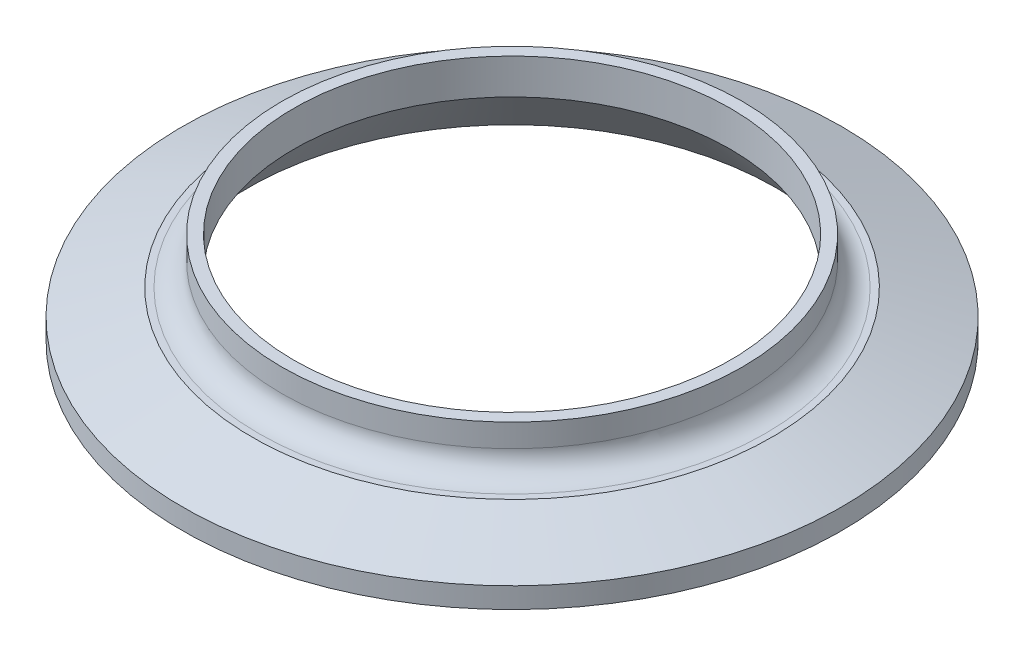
from build123d import *


with BuildPart() as part:
    # Sketch1 → Revolve1 (revolve)
    with BuildSketch(Plane.XY, mode=Mode.PRIVATE) as revolve1_sk:
        with BuildLine():
            Line((-31.75, 12.7), (-31.75, 9.525))
            ThreePointArc((-31.75, 9.525), (-32.67993597, 7.27993597), (-34.925, 6.35))
            Line((-34.925, 6.35), (-35.822842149, 6.35))
            Line((-35.822842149, 6.35), (-45.4533, 2.8448))
            Line((-45.4533, 2.8448), (-45.4533, 0))
            Line((-45.4533, 0), (-43.659272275, 0.002512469))
            ThreePointArc((-43.659272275, 0.002512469), (-43.224677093, 0.133310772), (-42.934466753, 0.482250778))
            Line((-42.934466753, 0.482250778), (-42.767598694, 0.87536729))
            ThreePointArc((-42.767598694, 0.87536729), (-41.6687, 1.602712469), (-40.569801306, 0.87536729))
            Line((-40.569801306, 0.87536729), (-40.402933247, 0.482250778))
            ThreePointArc((-40.402933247, 0.482250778), (-40.112722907, 0.133310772), (-39.678127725, 0.002512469))
            Line((-39.678127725, 0.002512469), (-36.449, 0))
            Line((-36.449, 0), (-30.099, 7.813673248))
            Line((-30.099, 7.813673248), (-30.099, 12.7))
            Line((-30.099, 12.7), (-31.75, 12.7))
        make_face()
    revolve(revolve1_sk.sketch.rotate(Axis((0, 0, 0), (0, 1, 0)), 270), axis=Axis((0, 0, 0), (0, 1, 0)))


solid = part.part
